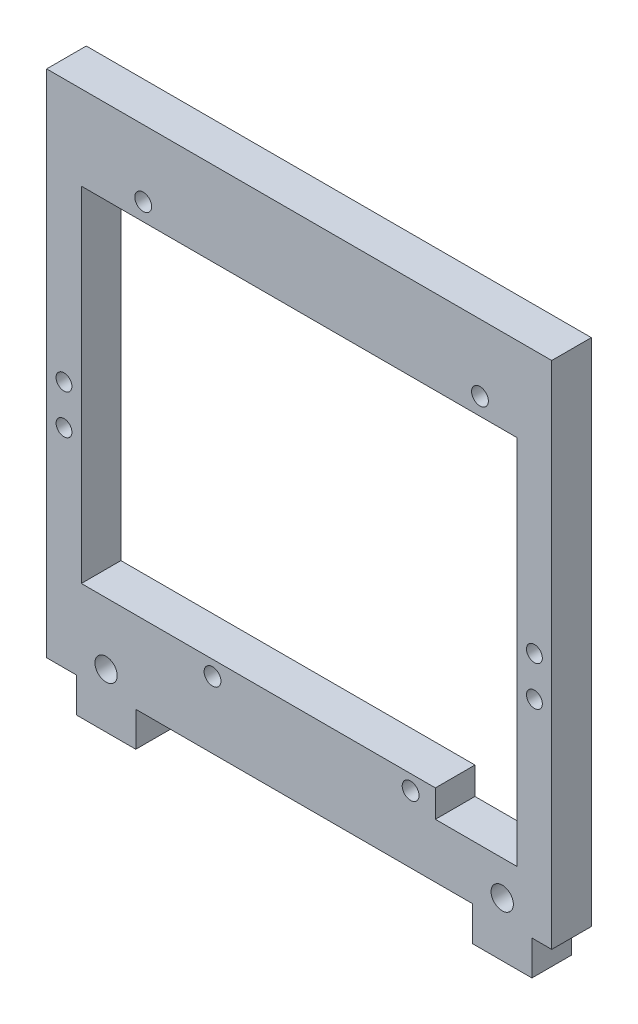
from build123d import *

# Parameters (mm, degrees)
SKETCH_1_R                                 = 1.7
SKETCH_1_R_2                               = 2.25
SKETCH_1_R_3                               = 1.6
OPEN_FRAME_M3_BOARD_AND_M4_LEG_HOLES_DEPTH = 8


with BuildPart() as part:
    # Sketch 1 → Open_frame_M3_board_and_M4_leg_holes (new body)
    with BuildSketch(Plane.XY):
        Polygon((-52, -57), (-46, -57), (-46, -64), (-34, -64), (-34, -57), (34, -57), (34, -64), (46, -64), (46, -57), (50, -57), (50, 46), (-52, 46), align=None)
        with Locations((-32.5, 32.5)):
            Circle(SKETCH_1_R, mode=Mode.SUBTRACT)
        with Locations((35.5, 32.5)):
            Circle(SKETCH_1_R, mode=Mode.SUBTRACT)
        with Locations((-18.5, -43.5)):
            Circle(SKETCH_1_R, mode=Mode.SUBTRACT)
        with Locations((21.5, -43.5)):
            Circle(SKETCH_1_R, mode=Mode.SUBTRACT)
        with Locations((-40, -53)):
            Circle(SKETCH_1_R_2, mode=Mode.SUBTRACT)
        with Locations((40, -53)):
            Circle(SKETCH_1_R_2, mode=Mode.SUBTRACT)
        with Locations((-48.5, -15)):
            Circle(SKETCH_1_R_3, mode=Mode.SUBTRACT)
        with Locations((-48.5, -7)):
            Circle(SKETCH_1_R_3, mode=Mode.SUBTRACT)
        with Locations((46.5, -15)):
            Circle(SKETCH_1_R_3, mode=Mode.SUBTRACT)
        with Locations((46.5, -7)):
            Circle(SKETCH_1_R_3, mode=Mode.SUBTRACT)
        Polygon((-45, -40.5), (26.5, -40.5), (26.5, -46), (43, -46), (43, 29), (-45, 29), align=None, mode=Mode.SUBTRACT)
    extrude(amount=OPEN_FRAME_M3_BOARD_AND_M4_LEG_HOLES_DEPTH)


solid = part.part
